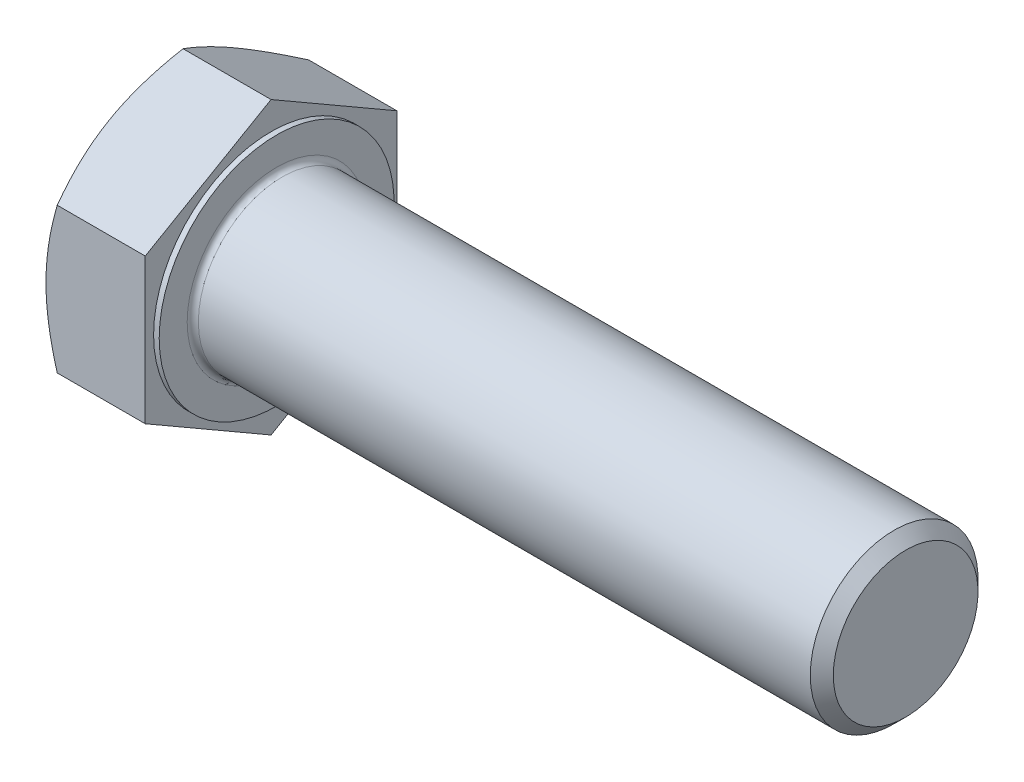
from build123d import *

# Parameters (mm, degrees)
BASEHEAD_DEPTH   = 15
BEARINGFACESKE_W = 0.8
BEARINGFACESKE_H = 3.979609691
FILLET_2_R       = 0.8


with BuildPart() as part:
    # BaseHeadSke → BaseHead (new body)
    with BuildSketch(Plane(origin=(0, 0, 0), x_dir=(0, 0, -1), z_dir=(1, 0, 0))):
        Polygon((18, 10.392304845), (0, 20.784609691), (-18, 10.392304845), (-18, -10.392304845), (0, -20.784609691), (18, -10.392304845), align=None)
    extrude(amount=BASEHEAD_DEPTH)

    # BodySke → BaseBody (revolve)
    with BuildSketch(Plane.XY, mode=Mode.PRIVATE) as basebody_sk:
        Polygon((0, 0), (105, 0), (105, 10.352), (103.352, 12), (0, 12), align=None)
    revolve(basebody_sk.sketch.rotate(Axis((0, 0, 0), (1, 0, 0)), 90), axis=Axis((0, 0, 0), (1, 0, 0)))

    # HeadChamferSke → HeadChamfer (revolve, cut)
    with BuildSketch(Plane.XY):
        Polygon((1.607695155, 20.784609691), (0, 20.784609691), (0, 18), align=None)
    revolve(axis=Axis((0, 0, 0), (1, 0, 0)), mode=Mode.SUBTRACT)

    # BearingFaceSke → BearingFace (revolve, cut)
    with BuildSketch(Plane.XY, mode=Mode.PRIVATE) as bearingface_sk:
        with Locations((14.6, 18.794804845)):
            Rectangle(BEARINGFACESKE_W, BEARINGFACESKE_H)
    revolve(bearingface_sk.sketch.rotate(Axis((0, 0, 0), (1, 0, 0)), 90), axis=Axis((0, 0, 0), (1, 0, 0)), mode=Mode.SUBTRACT)

    # Fillet 2
    fillet_2_edges = [part.edges().sort_by_distance(p)[0] for p in [
        (15, 0, -12),
    ]]
    fillet(fillet_2_edges, radius=FILLET_2_R)


solid = part.part
